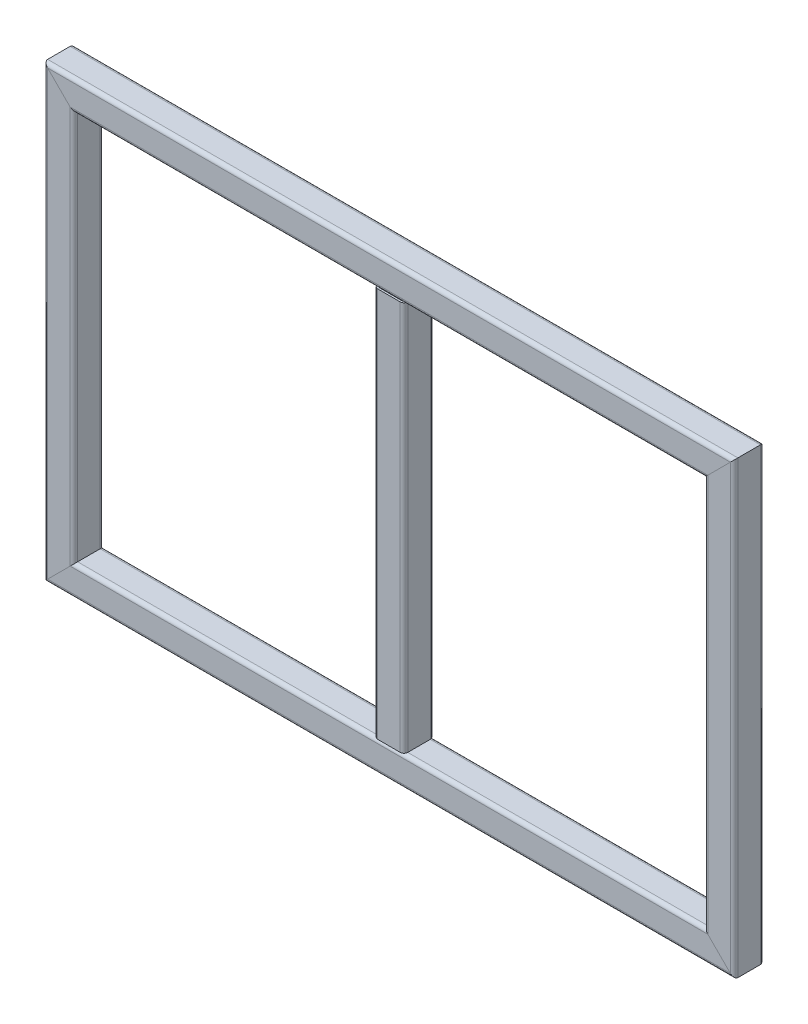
from build123d import *

# Parameters (mm, degrees)
CZ_ON_KONSTRUKCYJNY1_DEPTH      = 1177.568542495
CZ_ON_KONSTRUKCYJNY1_DEPTH_BACK = 57.568542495
CZ_ON_KONSTRUKCYJNY1_2_DEPTH    = 1875.13708499
CZ_ON_KONSTRUKCYJNY1_3_DEPTH    = 1235.13708499
CZ_ON_KONSTRUKCYJNY1_4_DEPTH    = 1875.13708499
CZ_ON_KONSTRUKCYJNY1_5_DEPTH    = 1122


with BuildPart() as part:
    # Sketch1 → Cz_on konstrukcyjny1 (new, two sides: drawn at the far end of the back side and taken through both)
    with BuildSketch(Plane(origin=(-880, -1200, 0), x_dir=(-1, 0, 0), z_dir=(0, 1, 0)).offset(-CZ_ON_KONSTRUKCYJNY1_DEPTH_BACK)):
        with BuildLine():
            Line((-30, -40), (30, -40))
            ThreePointArc((30, -40), (37.071067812, -37.071067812), (40, -30))
            Line((40, -30), (40, 30))
            ThreePointArc((40, 30), (37.071067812, 37.071067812), (30, 40))
            Line((30, 40), (-30, 40))
            ThreePointArc((-30, 40), (-37.071067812, 37.071067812), (-40, 30))
            Line((-40, 30), (-40, -30))
            ThreePointArc((-40, -30), (-37.071067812, -37.071067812), (-30, -40))
        make_face()
        with BuildLine():
            Line((-30, -35), (30, -35))
            ThreePointArc((30, -35), (33.535533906, -33.535533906), (35, -30))
            Line((35, -30), (35, 30))
            ThreePointArc((35, 30), (33.535533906, 33.535533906), (30, 35))
            Line((30, 35), (-30, 35))
            ThreePointArc((-30, 35), (-33.535533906, 33.535533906), (-35, 30))
            Line((-35, 30), (-35, -30))
            ThreePointArc((-35, -30), (-33.535533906, -33.535533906), (-30, -35))
        make_face(mode=Mode.SUBTRACT)
    extrude(amount=CZ_ON_KONSTRUKCYJNY1_DEPTH + CZ_ON_KONSTRUKCYJNY1_DEPTH_BACK)

    # Cz_on konstrukcyjny1 mitre 1
    split(bisect_by=Plane(origin=(-880, -1200, 0), x_dir=(-0.707106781, -0.707106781, 0), z_dir=(-0.707106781, 0.707106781, 0)), keep=Keep.TOP)

    # Cz_on konstrukcyjny1 mitre 2
    split(bisect_by=Plane(origin=(-880, -80, 0), x_dir=(0.707106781, -0.707106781, 0), z_dir=(-0.707106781, -0.707106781, 0)), keep=Keep.TOP)


with BuildPart() as body_2:
    # Sketch1 on segment 2 (on carried to segment 2) → Cz_on konstrukcyjny1 2 (new body)
    with BuildSketch(Plane(origin=(-937.568542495, -80, 0), x_dir=(0, 1, 0), z_dir=(1, 0, 0))):
        with BuildLine():
            Line((-30, -40), (30, -40))
            ThreePointArc((30, -40), (37.071067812, -37.071067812), (40, -30))
            Line((40, -30), (40, 30))
            ThreePointArc((40, 30), (37.071067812, 37.071067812), (30, 40))
            Line((30, 40), (-30, 40))
            ThreePointArc((-30, 40), (-37.071067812, 37.071067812), (-40, 30))
            Line((-40, 30), (-40, -30))
            ThreePointArc((-40, -30), (-37.071067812, -37.071067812), (-30, -40))
        make_face()
        with BuildLine():
            Line((-30, -35), (30, -35))
            ThreePointArc((30, -35), (33.535533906, -33.535533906), (35, -30))
            Line((35, -30), (35, 30))
            ThreePointArc((35, 30), (33.535533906, 33.535533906), (30, 35))
            Line((30, 35), (-30, 35))
            ThreePointArc((-30, 35), (-33.535533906, 33.535533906), (-35, 30))
            Line((-35, 30), (-35, -30))
            ThreePointArc((-35, -30), (-33.535533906, -33.535533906), (-30, -35))
        make_face(mode=Mode.SUBTRACT)
    extrude(amount=CZ_ON_KONSTRUKCYJNY1_2_DEPTH)

    # Cz_on konstrukcyjny1 2 mitre 1
    split(bisect_by=Plane(origin=(-880, -80, 0), x_dir=(-0.707106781, 0.707106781, 0), z_dir=(0.707106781, 0.707106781, 0)), keep=Keep.TOP)

    # Cz_on konstrukcyjny1 2 mitre 2
    split(bisect_by=Plane(origin=(880, -80, 0), x_dir=(-0.707106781, -0.707106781, 0), z_dir=(-0.707106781, 0.707106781, 0)), keep=Keep.TOP)


with BuildPart() as body_3:
    # Sketch1 on segment 3 (on carried to segment 3) → Cz_on konstrukcyjny1 3 (new body)
    with BuildSketch(Plane(origin=(880, -22.431457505, 0), x_dir=(1, 0, 0), z_dir=(0, -1, 0))):
        with BuildLine():
            Line((-30, -40), (30, -40))
            ThreePointArc((30, -40), (37.071067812, -37.071067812), (40, -30))
            Line((40, -30), (40, 30))
            ThreePointArc((40, 30), (37.071067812, 37.071067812), (30, 40))
            Line((30, 40), (-30, 40))
            ThreePointArc((-30, 40), (-37.071067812, 37.071067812), (-40, 30))
            Line((-40, 30), (-40, -30))
            ThreePointArc((-40, -30), (-37.071067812, -37.071067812), (-30, -40))
        make_face()
        with BuildLine():
            Line((-30, -35), (30, -35))
            ThreePointArc((30, -35), (33.535533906, -33.535533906), (35, -30))
            Line((35, -30), (35, 30))
            ThreePointArc((35, 30), (33.535533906, 33.535533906), (30, 35))
            Line((30, 35), (-30, 35))
            ThreePointArc((-30, 35), (-33.535533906, 33.535533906), (-35, 30))
            Line((-35, 30), (-35, -30))
            ThreePointArc((-35, -30), (-33.535533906, -33.535533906), (-30, -35))
        make_face(mode=Mode.SUBTRACT)
    extrude(amount=CZ_ON_KONSTRUKCYJNY1_3_DEPTH)

    # Cz_on konstrukcyjny1 3 mitre 1
    split(bisect_by=Plane(origin=(880, -1200, 0), x_dir=(-0.707106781, 0.707106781, 0), z_dir=(0.707106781, 0.707106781, 0)), keep=Keep.TOP)

    # Cz_on konstrukcyjny1 3 mitre 2
    split(bisect_by=Plane(origin=(880, -80, 0), x_dir=(0.707106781, 0.707106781, 0), z_dir=(0.707106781, -0.707106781, 0)), keep=Keep.TOP)


with BuildPart() as body_4:
    # Sketch1 on segment 4 (on carried to segment 4) → Cz_on konstrukcyjny1 4 (new body)
    with BuildSketch(Plane(origin=(937.568542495, -1200, 0), x_dir=(0, -1, 0), z_dir=(-1, 0, 0))):
        with BuildLine():
            Line((-30, -40), (30, -40))
            ThreePointArc((30, -40), (37.071067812, -37.071067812), (40, -30))
            Line((40, -30), (40, 30))
            ThreePointArc((40, 30), (37.071067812, 37.071067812), (30, 40))
            Line((30, 40), (-30, 40))
            ThreePointArc((-30, 40), (-37.071067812, 37.071067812), (-40, 30))
            Line((-40, 30), (-40, -30))
            ThreePointArc((-40, -30), (-37.071067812, -37.071067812), (-30, -40))
        make_face()
        with BuildLine():
            Line((-30, -35), (30, -35))
            ThreePointArc((30, -35), (33.535533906, -33.535533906), (35, -30))
            Line((35, -30), (35, 30))
            ThreePointArc((35, 30), (33.535533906, 33.535533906), (30, 35))
            Line((30, 35), (-30, 35))
            ThreePointArc((-30, 35), (-33.535533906, 33.535533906), (-35, 30))
            Line((-35, 30), (-35, -30))
            ThreePointArc((-35, -30), (-33.535533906, -33.535533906), (-30, -35))
        make_face(mode=Mode.SUBTRACT)
    extrude(amount=CZ_ON_KONSTRUKCYJNY1_4_DEPTH)

    # Cz_on konstrukcyjny1 4 mitre 1
    split(bisect_by=Plane(origin=(-880, -1200, 0), x_dir=(0.707106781, 0.707106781, 0), z_dir=(0.707106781, -0.707106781, 0)), keep=Keep.TOP)

    # Cz_on konstrukcyjny1 4 mitre 2
    split(bisect_by=Plane(origin=(880, -1200, 0), x_dir=(0.707106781, -0.707106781, 0), z_dir=(-0.707106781, -0.707106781, 0)), keep=Keep.TOP)


with BuildPart() as body_5:
    # Sketch1 on segment 5 (on carried to segment 5) → Cz_on konstrukcyjny1 5 (new body)
    with BuildSketch(Plane.XZ.offset(79)):
        with BuildLine():
            Line((-30, -40), (30, -40))
            ThreePointArc((30, -40), (37.071067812, -37.071067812), (40, -30))
            Line((40, -30), (40, 30))
            ThreePointArc((40, 30), (37.071067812, 37.071067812), (30, 40))
            Line((30, 40), (-30, 40))
            ThreePointArc((-30, 40), (-37.071067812, 37.071067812), (-40, 30))
            Line((-40, 30), (-40, -30))
            ThreePointArc((-40, -30), (-37.071067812, -37.071067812), (-30, -40))
        make_face()
        with BuildLine():
            Line((-30, -35), (30, -35))
            ThreePointArc((30, -35), (33.535533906, -33.535533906), (35, -30))
            Line((35, -30), (35, 30))
            ThreePointArc((35, 30), (33.535533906, 33.535533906), (30, 35))
            Line((30, 35), (-30, 35))
            ThreePointArc((-30, 35), (-33.535533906, 33.535533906), (-35, 30))
            Line((-35, 30), (-35, -30))
            ThreePointArc((-35, -30), (-33.535533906, -33.535533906), (-30, -35))
        make_face(mode=Mode.SUBTRACT)
    extrude(amount=CZ_ON_KONSTRUKCYJNY1_5_DEPTH)

    # Cz_on konstrukcyjny1 5 mitre 1
    split(bisect_by=Plane.XZ.offset(120), keep=Keep.TOP)

    # Cz_on konstrukcyjny1 5 mitre 2
    split(bisect_by=Plane(origin=(0, -1160, 0), x_dir=(-1, 0, 0), z_dir=(0, 1, 0)), keep=Keep.TOP)


solid = Compound([part.part, body_2.part, body_3.part, body_4.part, body_5.part])
